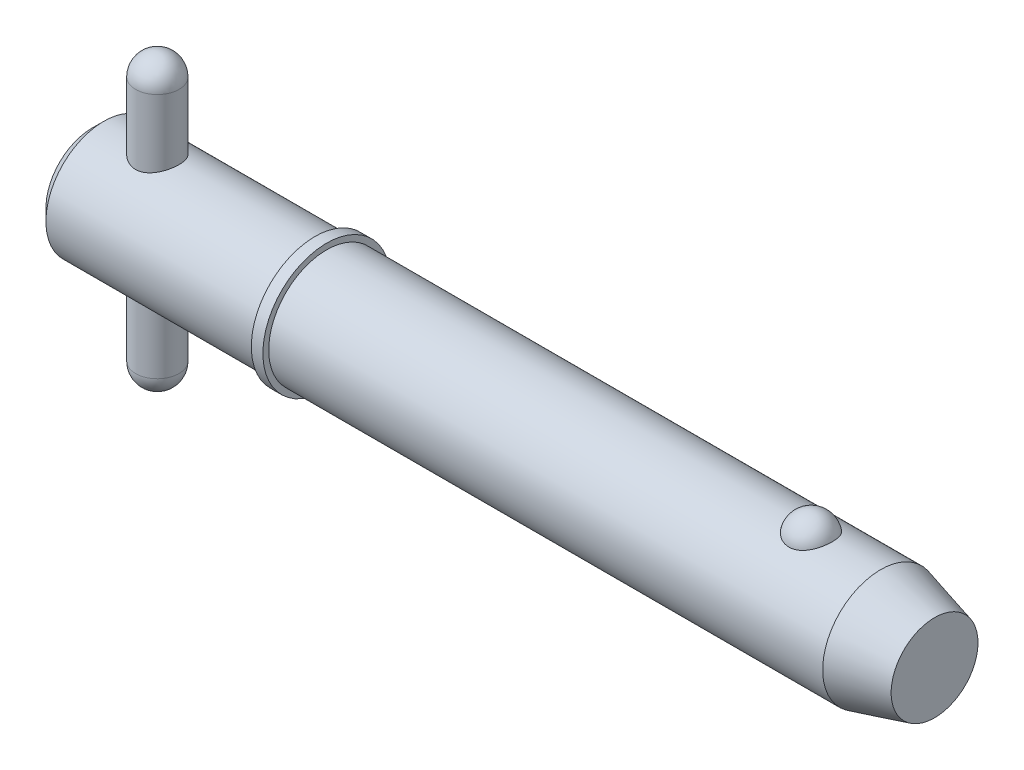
ISO-10303-21;
HEADER;
FILE_DESCRIPTION(('STEP AP214'),'2;1');
FILE_NAME('part.step','',(''),(''),'','','');
FILE_SCHEMA(('AUTOMOTIVE_DESIGN { 1 0 10303 214 1 1 1 1 }'));
ENDSEC;
DATA;
#1=APPLICATION_CONTEXT('core data for automotive mechanical design processes');
#2=APPLICATION_PROTOCOL_DEFINITION('international standard','automotive_design',2000,#1);
#3=PRODUCT_CONTEXT('',#1,'mechanical');
#4=PRODUCT('Part','Part','',(#3));
#5=PRODUCT_RELATED_PRODUCT_CATEGORY('part','',(#4));
#6=PRODUCT_DEFINITION_FORMATION('','',#4);
#7=PRODUCT_DEFINITION_CONTEXT('part definition',#1,'design');
#8=PRODUCT_DEFINITION('design','',#6,#7);
#9=PRODUCT_DEFINITION_SHAPE('','',#8);
#10=(LENGTH_UNIT() NAMED_UNIT(*) SI_UNIT(.MILLI.,.METRE.));
#11=(NAMED_UNIT(*) PLANE_ANGLE_UNIT() SI_UNIT($,.RADIAN.));
#12=(NAMED_UNIT(*) SI_UNIT($,.STERADIAN.) SOLID_ANGLE_UNIT());
#13=UNCERTAINTY_MEASURE_WITH_UNIT(LENGTH_MEASURE(1.E-05),#10,'distance_accuracy_value','');
#14=(GEOMETRIC_REPRESENTATION_CONTEXT(3) GLOBAL_UNCERTAINTY_ASSIGNED_CONTEXT((#13)) GLOBAL_UNIT_ASSIGNED_CONTEXT((#10,
#11,#12)) REPRESENTATION_CONTEXT('',''));
#15=CARTESIAN_POINT('',(0.,0.,0.));
#16=DIRECTION('',(0.,0.,1.));
#17=DIRECTION('',(1.,0.,0.));
#18=AXIS2_PLACEMENT_3D('',#15,#16,#17);
#19=CARTESIAN_POINT('',(7.14,15.875,0.));
#20=DIRECTION('',(0.,-1.,0.));
#21=DIRECTION('',(0.,0.,-1.));
#22=AXIS2_PLACEMENT_3D('',#19,#20,#21);
#23=CYLINDRICAL_SURFACE('',#22,2.38);
#24=CARTESIAN_POINT('',(7.14,-13.495,0.));
#25=DIRECTION('',(0.,-1.,0.));
#26=DIRECTION('',(0.,0.,-1.));
#27=AXIS2_PLACEMENT_3D('',#24,#25,#26);
#28=CIRCLE('',#27,2.38);
#29=CARTESIAN_POINT('',(7.14,-13.495,-2.38));
#30=VERTEX_POINT('',#29);
#31=EDGE_CURVE('P0_E10',#30,#30,#28,.F.);
#32=ORIENTED_EDGE('',*,*,#31,.T.);
#33=EDGE_LOOP('',(#32));
#34=FACE_BOUND('',#33,.T.);
#35=CARTESIAN_POINT('',(7.14,13.495,0.));
#36=DIRECTION('',(0.,-1.,0.));
#37=DIRECTION('',(0.,0.,-1.));
#38=AXIS2_PLACEMENT_3D('',#35,#36,#37);
#39=CIRCLE('',#38,2.38);
#40=CARTESIAN_POINT('',(7.14,13.495,-2.38));
#41=VERTEX_POINT('',#40);
#42=EDGE_CURVE('P0_E21',#41,#41,#39,.T.);
#43=ORIENTED_EDGE('',*,*,#42,.T.);
#44=EDGE_LOOP('',(#43));
#45=FACE_BOUND('',#44,.T.);
#46=ADVANCED_FACE('P0_F14',(#34,#45),#23,.T.);
#47=CARTESIAN_POINT('',(7.14,-13.495,0.));
#48=DIRECTION('',(0.,0.,1.));
#49=DIRECTION('',(1.,0.,0.));
#50=AXIS2_PLACEMENT_3D('',#47,#48,#49);
#51=SPHERICAL_SURFACE('',#50,2.38);
#52=CARTESIAN_POINT('',(7.14,-13.495,0.));
#53=DIRECTION('',(0.,-1.,0.));
#54=DIRECTION('',(0.,0.,-1.));
#55=AXIS2_PLACEMENT_3D('',#52,#53,#54);
#56=SPHERICAL_SURFACE('',#55,2.38);
#57=ORIENTED_EDGE('',*,*,#31,.F.);
#58=EDGE_LOOP('',(#57));
#59=FACE_BOUND('',#58,.T.);
#60=ADVANCED_FACE('P0_F29',(#59),#56,.T.);
#61=CARTESIAN_POINT('',(7.14,13.495,0.));
#62=DIRECTION('',(0.,0.,1.));
#63=DIRECTION('',(1.,0.,0.));
#64=AXIS2_PLACEMENT_3D('',#61,#62,#63);
#65=SPHERICAL_SURFACE('',#64,2.38);
#66=CARTESIAN_POINT('',(7.14,13.495,0.));
#67=DIRECTION('',(0.,-1.,0.));
#68=DIRECTION('',(0.,0.,-1.));
#69=AXIS2_PLACEMENT_3D('',#66,#67,#68);
#70=SPHERICAL_SURFACE('',#69,2.38);
#71=ORIENTED_EDGE('',*,*,#42,.F.);
#72=EDGE_LOOP('',(#71));
#73=FACE_BOUND('',#72,.T.);
#74=ADVANCED_FACE('P0_F16',(#73),#70,.T.);
#75=CLOSED_SHELL('',(#46,#60,#74));
#76=MANIFOLD_SOLID_BREP('P0_B1',#75);
#77=CARTESIAN_POINT('',(0.,0.,0.));
#78=DIRECTION('',(1.,0.,0.));
#79=DIRECTION('',(0.,0.,-1.));
#80=AXIS2_PLACEMENT_3D('',#77,#78,#79);
#81=CYLINDRICAL_SURFACE('',#80,6.35);
#82=CARTESIAN_POINT('',(86.4553693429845,0.,0.));
#83=DIRECTION('',(1.,0.,0.));
#84=DIRECTION('',(0.,0.,-1.));
#85=AXIS2_PLACEMENT_3D('',#82,#83,#84);
#86=CIRCLE('',#85,6.35);
#87=CARTESIAN_POINT('',(86.4553693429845,0.,-6.35));
#88=VERTEX_POINT('',#87);
#89=EDGE_CURVE('P1_E81',#88,#88,#86,.T.);
#90=ORIENTED_EDGE('',*,*,#89,.F.);
#91=EDGE_LOOP('',(#90));
#92=FACE_BOUND('',#91,.T.);
#93=CARTESIAN_POINT('',(25.7,0.,0.));
#94=DIRECTION('',(1.,0.,0.));
#95=DIRECTION('',(0.,0.,-1.));
#96=AXIS2_PLACEMENT_3D('',#93,#94,#95);
#97=CIRCLE('',#96,6.35);
#98=CARTESIAN_POINT('',(25.7,0.,-6.35));
#99=VERTEX_POINT('',#98);
#100=EDGE_CURVE('P1_E85',#99,#99,#97,.T.);
#101=ORIENTED_EDGE('',*,*,#100,.T.);
#102=EDGE_LOOP('',(#101));
#103=FACE_BOUND('',#102,.T.);
#104=CARTESIAN_POINT('',(78.8300214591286,5.87502187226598,2.40969251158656));
#105=CARTESIAN_POINT('',(78.7050305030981,5.87501645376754,2.40969773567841));
#106=CARTESIAN_POINT('',(78.5800806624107,5.87916061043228,2.39967292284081));
#107=CARTESIAN_POINT('',(78.3339091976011,5.89523112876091,2.35991730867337));
#108=CARTESIAN_POINT('',(78.2126863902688,5.90715499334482,2.33019283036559));
#109=CARTESIAN_POINT('',(77.9775170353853,5.9373956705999,2.25201402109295));
#110=CARTESIAN_POINT('',(77.8635602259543,5.95570321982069,2.20358681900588));
#111=CARTESIAN_POINT('',(77.6455735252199,5.99672067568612,2.08937987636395));
#112=CARTESIAN_POINT('',(77.5415457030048,6.01943149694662,2.02359652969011));
#113=CARTESIAN_POINT('',(77.3429437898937,6.06760647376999,1.87428969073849));
#114=CARTESIAN_POINT('',(77.2487268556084,6.09313095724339,1.79031110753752));
#115=CARTESIAN_POINT('',(77.0752557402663,6.14375873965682,1.60800178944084));
#116=CARTESIAN_POINT('',(76.9960043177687,6.16886196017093,1.50966841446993));
#117=CARTESIAN_POINT('',(76.8508457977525,6.2172460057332,1.29645884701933));
#118=CARTESIAN_POINT('',(76.7856885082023,6.24039621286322,1.18104158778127));
#119=CARTESIAN_POINT('',(76.6747035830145,6.28117277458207,0.940351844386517));
#120=CARTESIAN_POINT('',(76.6288776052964,6.29879865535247,0.815078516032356));
#121=CARTESIAN_POINT('',(76.5570234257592,6.32692073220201,0.556494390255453));
#122=CARTESIAN_POINT('',(76.531249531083,6.33732517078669,0.423102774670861));
#123=CARTESIAN_POINT('',(76.5009885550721,6.34957673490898,0.153542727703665));
#124=CARTESIAN_POINT('',(76.4965009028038,6.35142408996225,0.017374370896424));
#125=CARTESIAN_POINT('',(76.5088655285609,6.34638925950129,-0.253036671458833));
#126=CARTESIAN_POINT('',(76.5255949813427,6.33955731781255,-0.387285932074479));
#127=CARTESIAN_POINT('',(76.5798438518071,6.31794129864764,-0.650851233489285));
#128=CARTESIAN_POINT('',(76.6173636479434,6.30315707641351,-0.7801671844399));
#129=CARTESIAN_POINT('',(76.712500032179,6.26711642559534,-1.03041949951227));
#130=CARTESIAN_POINT('',(76.770143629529,6.24585130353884,-1.1513443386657));
#131=CARTESIAN_POINT('',(76.9043522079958,6.19905619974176,-1.38129800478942));
#132=CARTESIAN_POINT('',(76.9809187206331,6.17352587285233,-1.49032586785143));
#133=CARTESIAN_POINT('',(77.1517538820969,6.12080227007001,-1.69393164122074));
#134=CARTESIAN_POINT('',(77.2461008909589,6.09360200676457,-1.78844209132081));
#135=CARTESIAN_POINT('',(77.4501196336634,6.0407043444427,-1.95970536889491));
#136=CARTESIAN_POINT('',(77.5597900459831,6.01500681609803,-2.03645972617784));
#137=CARTESIAN_POINT('',(77.7891876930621,5.96867714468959,-2.16845644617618));
#138=CARTESIAN_POINT('',(77.9086522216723,5.94794910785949,-2.22412062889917));
#139=CARTESIAN_POINT('',(78.1562188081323,5.91340580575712,-2.31440992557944));
#140=CARTESIAN_POINT('',(78.2843175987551,5.89958794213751,-2.34904294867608));
#141=CARTESIAN_POINT('',(78.538582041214,5.88111049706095,-2.39491590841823));
#142=CARTESIAN_POINT('',(78.6645207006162,5.87602512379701,-2.40724512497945));
#143=CARTESIAN_POINT('',(78.9167867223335,5.87428980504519,-2.41147867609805));
#144=CARTESIAN_POINT('',(79.043114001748,5.87763817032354,-2.40338710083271));
#145=CARTESIAN_POINT('',(79.2884170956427,5.89212921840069,-2.36762715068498));
#146=CARTESIAN_POINT('',(79.4074992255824,5.90302431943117,-2.34058030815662));
#147=CARTESIAN_POINT('',(79.6392447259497,5.93113752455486,-2.2683906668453));
#148=CARTESIAN_POINT('',(79.7519075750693,5.94835614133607,-2.22324640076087));
#149=CARTESIAN_POINT('',(79.9704009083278,5.98773016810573,-2.11493806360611));
#150=CARTESIAN_POINT('',(80.076028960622,6.00998499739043,-2.05140269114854));
#151=CARTESIAN_POINT('',(80.2753006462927,6.0569014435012,-1.90842705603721));
#152=CARTESIAN_POINT('',(80.3689415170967,6.08156361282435,-1.82898313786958));
#153=CARTESIAN_POINT('',(80.5466754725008,6.13211715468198,-1.6518242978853));
#154=CARTESIAN_POINT('',(80.630055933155,6.15800825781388,-1.55339381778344));
#155=CARTESIAN_POINT('',(80.7797900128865,6.20712834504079,-1.34374214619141));
#156=CARTESIAN_POINT('',(80.8461405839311,6.23035685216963,-1.23251867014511));
#157=CARTESIAN_POINT('',(80.9623455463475,6.27251177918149,-0.99644720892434));
#158=CARTESIAN_POINT('',(81.0116072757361,6.29127762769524,-0.871278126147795));
#159=CARTESIAN_POINT('',(81.0896142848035,6.3215862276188,-0.613870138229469));
#160=CARTESIAN_POINT('',(81.1183593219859,6.33312889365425,-0.481631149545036));
#161=CARTESIAN_POINT('',(81.1547705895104,6.34782349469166,-0.213672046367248));
#162=CARTESIAN_POINT('',(81.1624134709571,6.35096613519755,-0.077948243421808));
#163=CARTESIAN_POINT('',(81.1563951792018,6.34851322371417,0.19294395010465));
#164=CARTESIAN_POINT('',(81.1427343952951,6.3429178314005,0.328112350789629));
#165=CARTESIAN_POINT('',(81.0945036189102,6.32360512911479,0.593406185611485));
#166=CARTESIAN_POINT('',(81.0600313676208,6.30992579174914,0.723552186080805));
#167=CARTESIAN_POINT('',(80.9709539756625,6.27586325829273,0.975834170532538));
#168=CARTESIAN_POINT('',(80.9163476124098,6.25547965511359,1.09796966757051));
#169=CARTESIAN_POINT('',(80.7877587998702,6.20998183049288,1.33148921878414));
#170=CARTESIAN_POINT('',(80.7136742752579,6.18484288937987,1.44281227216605));
#171=CARTESIAN_POINT('',(80.5478204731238,6.13258735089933,1.65087683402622));
#172=CARTESIAN_POINT('',(80.4560515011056,6.10547078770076,1.74761859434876));
#173=CARTESIAN_POINT('',(80.2571839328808,6.05235879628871,1.92350926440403));
#174=CARTESIAN_POINT('',(80.150133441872,6.02636017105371,2.00271146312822));
#175=CARTESIAN_POINT('',(79.9231384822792,5.97843747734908,2.14154159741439));
#176=CARTESIAN_POINT('',(79.803191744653,5.95651412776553,2.2011660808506));
#177=CARTESIAN_POINT('',(79.5445236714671,5.91812106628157,2.30250570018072));
#178=CARTESIAN_POINT('',(79.4050698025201,5.90217533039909,2.34256795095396));
#179=CARTESIAN_POINT('',(79.1203974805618,5.88063128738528,2.39615214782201));
#180=CARTESIAN_POINT('',(78.9751817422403,5.87502816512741,2.40968644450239));
#181=CARTESIAN_POINT('',(78.8300214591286,5.87502187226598,2.40969251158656));
#182=B_SPLINE_CURVE_WITH_KNOTS('',3,(#104,#105,#106,#107,#108,#109,#110,#111,#112,#113,#114,
#115,#116,#117,#118,#119,#120,#121,#122,#123,#124,#125,#126,#127,#128,#129,#130,#131,#132,#133,
#134,#135,#136,#137,#138,#139,#140,#141,#142,#143,#144,#145,#146,#147,#148,#149,#150,#151,#152,
#153,#154,#155,#156,#157,#158,#159,#160,#161,#162,#163,#164,#165,#166,#167,#168,#169,#170,#171,
#172,#173,#174,#175,#176,#177,#178,#179,#180,#181),.UNSPECIFIED.,.T.,.F.,(4,2,2,2,2,2,2,2,2,2,2,
2,2,2,2,2,2,2,2,2,2,2,2,2,2,2,2,2,2,2,2,2,2,2,2,2,2,2,4),(0.,0.374440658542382,
0.748761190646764,1.12254078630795,1.49639810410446,1.8809887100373,2.26565013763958,
2.66741104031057,3.0692063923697,3.47601794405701,3.88281858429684,4.28727498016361,
4.69173873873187,5.09674745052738,5.50178895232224,5.90865911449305,6.31549420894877,
6.71369855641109,7.11175305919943,7.48978077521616,7.86773278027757,8.23383886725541,
8.59997464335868,8.97409044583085,9.34829231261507,9.74122667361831,10.1342313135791,
10.539752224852,10.945277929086,11.3512521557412,11.7572189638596,12.1612938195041,
12.5653932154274,12.9716540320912,13.37790783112,13.782909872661,14.1879832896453,
14.6230486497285,15.0579114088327),.UNSPECIFIED.);
#183=CARTESIAN_POINT('',(78.8300214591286,5.87502187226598,2.40969251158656));
#184=VERTEX_POINT('',#183);
#185=EDGE_CURVE('P1_E35',#184,#184,#182,.T.);
#186=ORIENTED_EDGE('',*,*,#185,.T.);
#187=EDGE_LOOP('',(#186));
#188=FACE_BOUND('',#187,.T.);
#189=ADVANCED_FACE('P1_F13',(#92,#103,#188),#81,.T.);
#190=CARTESIAN_POINT('',(0.,0.,0.));
#191=DIRECTION('',(-1.,0.,0.));
#192=DIRECTION('',(0.,0.,1.));
#193=AXIS2_PLACEMENT_3D('',#190,#191,#192);
#194=PLANE('',#193);
#195=CARTESIAN_POINT('',(0.,0.,0.));
#196=DIRECTION('',(1.,0.,0.));
#197=DIRECTION('',(0.,0.,-1.));
#198=AXIS2_PLACEMENT_3D('',#195,#196,#197);
#199=CIRCLE('',#198,5.08);
#200=CARTESIAN_POINT('',(0.,0.,-5.08));
#201=VERTEX_POINT('',#200);
#202=EDGE_CURVE('P1_E9',#201,#201,#199,.T.);
#203=ORIENTED_EDGE('',*,*,#202,.F.);
#204=EDGE_LOOP('',(#203));
#205=FACE_BOUND('',#204,.T.);
#206=ADVANCED_FACE('P1_F15',(#205),#194,.T.);
#207=CARTESIAN_POINT('',(1.27,0.,0.));
#208=DIRECTION('',(1.,0.,0.));
#209=DIRECTION('',(0.,0.,-1.));
#210=AXIS2_PLACEMENT_3D('',#207,#208,#209);
#211=CONICAL_SURFACE('',#210,6.35,0.78539816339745);
#212=ORIENTED_EDGE('',*,*,#202,.T.);
#213=EDGE_LOOP('',(#212));
#214=FACE_BOUND('',#213,.T.);
#215=CARTESIAN_POINT('',(1.27,0.,0.));
#216=DIRECTION('',(1.,0.,0.));
#217=DIRECTION('',(0.,0.,-1.));
#218=AXIS2_PLACEMENT_3D('',#215,#216,#217);
#219=CIRCLE('',#218,6.35);
#220=CARTESIAN_POINT('',(1.27,0.,-6.35));
#221=VERTEX_POINT('',#220);
#222=EDGE_CURVE('P1_E26',#221,#221,#219,.T.);
#223=ORIENTED_EDGE('',*,*,#222,.F.);
#224=EDGE_LOOP('',(#223));
#225=FACE_BOUND('',#224,.T.);
#226=ADVANCED_FACE('P1_F77',(#214,#225),#211,.T.);
#227=CARTESIAN_POINT('',(0.,0.,0.));
#228=DIRECTION('',(1.,0.,0.));
#229=DIRECTION('',(0.,0.,-1.));
#230=AXIS2_PLACEMENT_3D('',#227,#228,#229);
#231=CYLINDRICAL_SURFACE('',#230,6.35);
#232=CARTESIAN_POINT('',(7.14,-5.88711304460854,2.38));
#233=CARTESIAN_POINT('',(7.01146258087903,-5.88710856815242,2.38000480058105));
#234=CARTESIAN_POINT('',(6.88295682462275,-5.89136840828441,2.36955244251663));
#235=CARTESIAN_POINT('',(6.62981934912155,-5.90782785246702,2.32820953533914));
#236=CARTESIAN_POINT('',(6.50518751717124,-5.92002722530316,2.29731958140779));
#237=CARTESIAN_POINT('',(6.26352403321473,-5.95079384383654,2.21639366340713));
#238=CARTESIAN_POINT('',(6.14647496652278,-5.96934583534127,2.16640353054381));
#239=CARTESIAN_POINT('',(5.92237941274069,-6.01070278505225,2.04885862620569));
#240=CARTESIAN_POINT('',(5.81533593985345,-6.03350901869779,1.98129858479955));
#241=CARTESIAN_POINT('',(5.60897525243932,-6.08207341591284,1.82693902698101));
#242=CARTESIAN_POINT('',(5.51022503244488,-6.10791836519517,1.73940861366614));
#243=CARTESIAN_POINT('',(5.32840561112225,-6.15892405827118,1.54914379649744));
#244=CARTESIAN_POINT('',(5.24533975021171,-6.1840846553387,1.44640616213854));
#245=CARTESIAN_POINT('',(5.09451639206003,-6.23191821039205,1.22434014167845));
#246=CARTESIAN_POINT('',(5.02737511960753,-6.25447755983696,1.10456656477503));
#247=CARTESIAN_POINT('',(4.91443001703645,-6.2935236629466,0.854429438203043));
#248=CARTESIAN_POINT('',(4.86861879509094,-6.31001251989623,0.724069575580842));
#249=CARTESIAN_POINT('',(4.80162253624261,-6.33444370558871,0.46242122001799));
#250=CARTESIAN_POINT('',(4.77946137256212,-6.34272370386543,0.331414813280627));
#251=CARTESIAN_POINT('',(4.75726677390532,-6.35101600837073,0.0672982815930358));
#252=CARTESIAN_POINT('',(4.75722615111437,-6.35103100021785,-0.0658111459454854));
#253=CARTESIAN_POINT('',(4.77870510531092,-6.3430064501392,-0.323358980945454));
#254=CARTESIAN_POINT('',(4.79915922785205,-6.33536494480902,-0.447900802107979));
#255=CARTESIAN_POINT('',(4.85925493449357,-6.31340794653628,-0.69163609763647));
#256=CARTESIAN_POINT('',(4.89889787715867,-6.29909198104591,-0.810829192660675));
#257=CARTESIAN_POINT('',(4.9967414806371,-6.26494471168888,-1.04254212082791));
#258=CARTESIAN_POINT('',(5.05520370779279,-6.24503620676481,-1.1549396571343));
#259=CARTESIAN_POINT('',(5.1887948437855,-6.20171869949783,-1.3686079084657));
#260=CARTESIAN_POINT('',(5.26392912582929,-6.17830856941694,-1.46987502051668));
#261=CARTESIAN_POINT('',(5.43386591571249,-6.12878580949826,-1.66468415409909));
#262=CARTESIAN_POINT('',(5.52956139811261,-6.10259519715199,-1.75742857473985));
#263=CARTESIAN_POINT('',(5.73530435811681,-6.05155777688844,-1.92585331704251));
#264=CARTESIAN_POINT('',(5.84535542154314,-6.02671130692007,-2.00152936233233));
#265=CARTESIAN_POINT('',(6.07982989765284,-5.98068420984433,-2.13519109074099));
#266=CARTESIAN_POINT('',(6.20451768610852,-5.95959698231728,-2.19274775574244));
#267=CARTESIAN_POINT('',(6.4628145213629,-5.92455622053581,-2.28574558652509));
#268=CARTESIAN_POINT('',(6.59641856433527,-5.91059872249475,-2.32119904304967));
#269=CARTESIAN_POINT('',(6.86087441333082,-5.8923327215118,-2.36717069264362));
#270=CARTESIAN_POINT('',(6.99147192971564,-5.8875347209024,-2.37895573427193));
#271=CARTESIAN_POINT('',(7.25283805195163,-5.88674545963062,-2.38091046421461));
#272=CARTESIAN_POINT('',(7.38360660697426,-5.89075200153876,-2.37108554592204));
#273=CARTESIAN_POINT('',(7.63510696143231,-5.90662331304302,-2.33124781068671));
#274=CARTESIAN_POINT('',(7.75602069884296,-5.91810660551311,-2.30221396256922));
#275=CARTESIAN_POINT('',(7.99120505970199,-5.94718527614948,-2.22601401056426));
#276=CARTESIAN_POINT('',(8.10547431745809,-5.96478190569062,-2.17884419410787));
#277=CARTESIAN_POINT('',(8.32888632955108,-6.00491533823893,-2.06572311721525));
#278=CARTESIAN_POINT('',(8.43767672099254,-6.02761250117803,-1.99913452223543));
#279=CARTESIAN_POINT('',(8.6429894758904,-6.07511988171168,-1.84974438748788));
#280=CARTESIAN_POINT('',(8.73950733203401,-6.09993087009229,-1.76693691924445));
#281=CARTESIAN_POINT('',(8.9238741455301,-6.1507686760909,-1.58125563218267));
#282=CARTESIAN_POINT('',(9.01078732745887,-6.17677301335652,-1.47744327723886));
#283=CARTESIAN_POINT('',(9.16607127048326,-6.22556172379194,-1.25606967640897));
#284=CARTESIAN_POINT('',(9.23444197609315,-6.24834608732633,-1.13850838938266));
#285=CARTESIAN_POINT('',(9.3502493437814,-6.28811144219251,-0.893050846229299));
#286=CARTESIAN_POINT('',(9.39775808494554,-6.30511236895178,-0.765192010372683));
#287=CARTESIAN_POINT('',(9.47032640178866,-6.33145833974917,-0.502514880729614));
#288=CARTESIAN_POINT('',(9.49539651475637,-6.34080697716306,-0.367699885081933));
#289=CARTESIAN_POINT('',(9.52124059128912,-6.35045496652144,-0.103396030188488));
#290=CARTESIAN_POINT('',(9.52334421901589,-6.35124952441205,0.025945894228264));
#291=CARTESIAN_POINT('',(9.50661518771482,-6.34499064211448,0.283061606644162));
#292=CARTESIAN_POINT('',(9.48778504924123,-6.33793814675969,0.410835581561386));
#293=CARTESIAN_POINT('',(9.43065630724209,-6.31700307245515,0.658028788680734));
#294=CARTESIAN_POINT('',(9.39284291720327,-6.30329098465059,0.7775756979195));
#295=CARTESIAN_POINT('',(9.29930406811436,-6.27046903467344,1.00863789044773));
#296=CARTESIAN_POINT('',(9.2435752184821,-6.25135815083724,1.12015164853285));
#297=CARTESIAN_POINT('',(9.11312349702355,-6.20865254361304,1.33711407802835));
#298=CARTESIAN_POINT('',(9.03770094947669,-6.18490316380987,1.44211105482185));
#299=CARTESIAN_POINT('',(8.87110640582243,-6.13583718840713,1.63836897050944));
#300=CARTESIAN_POINT('',(8.77992879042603,-6.11052003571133,1.72962498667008));
#301=CARTESIAN_POINT('',(8.57869799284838,-6.05953829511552,1.90076098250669));
#302=CARTESIAN_POINT('',(8.46790320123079,-6.03392573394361,1.97978778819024));
#303=CARTESIAN_POINT('',(8.23379693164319,-5.98676607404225,2.11813466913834));
#304=CARTESIAN_POINT('',(8.11048418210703,-5.9652193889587,2.17745273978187));
#305=CARTESIAN_POINT('',(7.84900037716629,-5.92818393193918,2.27641807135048));
#306=CARTESIAN_POINT('',(7.71041678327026,-5.91299857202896,2.31510015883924));
#307=CARTESIAN_POINT('',(7.42787316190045,-5.89246887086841,2.36688002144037));
#308=CARTESIAN_POINT('',(7.28391673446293,-5.88711805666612,2.37999462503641));
#309=CARTESIAN_POINT('',(7.14,-5.88711304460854,2.38));
#310=B_SPLINE_CURVE_WITH_KNOTS('',3,(#232,#233,#234,#235,#236,#237,#238,#239,#240,#241,#242,
#243,#244,#245,#246,#247,#248,#249,#250,#251,#252,#253,#254,#255,#256,#257,#258,#259,#260,#261,
#262,#263,#264,#265,#266,#267,#268,#269,#270,#271,#272,#273,#274,#275,#276,#277,#278,#279,#280,
#281,#282,#283,#284,#285,#286,#287,#288,#289,#290,#291,#292,#293,#294,#295,#296,#297,#298,#299,
#300,#301,#302,#303,#304,#305,#306,#307,#308,#309),.UNSPECIFIED.,.T.,.F.,(4,2,2,2,2,2,2,2,2,2,2,
2,2,2,2,2,2,2,2,2,2,2,2,2,2,2,2,2,2,2,2,2,2,2,2,2,2,2,4),(0.,0.385076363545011,
0.770141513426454,1.15428843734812,1.53855071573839,1.94016118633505,2.3418570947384,
2.75720522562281,3.1724093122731,3.569721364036,3.96690431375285,4.34445758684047,
4.72203759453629,5.10511017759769,5.48830640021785,5.89390240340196,6.29959991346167,
6.71428455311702,7.12873839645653,7.52034494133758,7.91185376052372,8.28480528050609,
8.65783318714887,9.0448340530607,9.43197664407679,9.84363087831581,10.2552863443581,
10.6655081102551,11.0755371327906,11.4616919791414,11.847800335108,12.224507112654,
12.6012852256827,12.9938941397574,13.386643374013,13.8000944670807,14.2135876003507,
14.6450218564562,15.0761720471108),.UNSPECIFIED.);
#311=CARTESIAN_POINT('',(7.14,-5.88711304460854,2.38));
#312=VERTEX_POINT('',#311);
#313=EDGE_CURVE('P1_E17',#312,#312,#310,.T.);
#314=ORIENTED_EDGE('',*,*,#313,.F.);
#315=EDGE_LOOP('',(#314));
#316=FACE_BOUND('',#315,.T.);
#317=CARTESIAN_POINT('',(7.14,5.88711304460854,2.38));
#318=CARTESIAN_POINT('',(7.26853741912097,5.88710856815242,2.38000480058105));
#319=CARTESIAN_POINT('',(7.39704317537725,5.89136840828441,2.36955244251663));
#320=CARTESIAN_POINT('',(7.65018065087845,5.90782785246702,2.32820953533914));
#321=CARTESIAN_POINT('',(7.77481248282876,5.92002722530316,2.29731958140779));
#322=CARTESIAN_POINT('',(8.01647596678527,5.95079384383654,2.21639366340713));
#323=CARTESIAN_POINT('',(8.13352503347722,5.96934583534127,2.16640353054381));
#324=CARTESIAN_POINT('',(8.35762058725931,6.01070278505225,2.04885862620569));
#325=CARTESIAN_POINT('',(8.46466406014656,6.03350901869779,1.98129858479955));
#326=CARTESIAN_POINT('',(8.67102474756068,6.08207341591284,1.82693902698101));
#327=CARTESIAN_POINT('',(8.76977496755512,6.10791836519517,1.73940861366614));
#328=CARTESIAN_POINT('',(8.95159438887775,6.15892405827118,1.54914379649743));
#329=CARTESIAN_POINT('',(9.03466024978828,6.1840846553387,1.44640616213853));
#330=CARTESIAN_POINT('',(9.18548360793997,6.23191821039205,1.22434014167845));
#331=CARTESIAN_POINT('',(9.25262488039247,6.25447755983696,1.10456656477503));
#332=CARTESIAN_POINT('',(9.36556998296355,6.2935236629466,0.854429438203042));
#333=CARTESIAN_POINT('',(9.41138120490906,6.31001251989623,0.72406957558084));
#334=CARTESIAN_POINT('',(9.47837746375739,6.33444370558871,0.462421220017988));
#335=CARTESIAN_POINT('',(9.50053862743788,6.34272370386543,0.331414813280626));
#336=CARTESIAN_POINT('',(9.52273322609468,6.35101600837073,0.0672982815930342));
#337=CARTESIAN_POINT('',(9.52277384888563,6.35103100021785,-0.0658111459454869));
#338=CARTESIAN_POINT('',(9.50129489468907,6.3430064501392,-0.323358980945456));
#339=CARTESIAN_POINT('',(9.48084077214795,6.33536494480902,-0.447900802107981));
#340=CARTESIAN_POINT('',(9.42074506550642,6.31340794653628,-0.691636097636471));
#341=CARTESIAN_POINT('',(9.38110212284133,6.29909198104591,-0.810829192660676));
#342=CARTESIAN_POINT('',(9.2832585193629,6.26494471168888,-1.04254212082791));
#343=CARTESIAN_POINT('',(9.22479629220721,6.24503620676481,-1.1549396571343));
#344=CARTESIAN_POINT('',(9.0912051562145,6.20171869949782,-1.3686079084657));
#345=CARTESIAN_POINT('',(9.0160708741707,6.17830856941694,-1.46987502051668));
#346=CARTESIAN_POINT('',(8.84613408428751,6.12878580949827,-1.66468415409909));
#347=CARTESIAN_POINT('',(8.75043860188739,6.10259519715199,-1.75742857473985));
#348=CARTESIAN_POINT('',(8.54469564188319,6.05155777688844,-1.92585331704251));
#349=CARTESIAN_POINT('',(8.43464457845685,6.02671130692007,-2.00152936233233));
#350=CARTESIAN_POINT('',(8.20017010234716,5.98068420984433,-2.13519109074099));
#351=CARTESIAN_POINT('',(8.07548231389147,5.95959698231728,-2.19274775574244));
#352=CARTESIAN_POINT('',(7.8171854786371,5.9245562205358,-2.28574558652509));
#353=CARTESIAN_POINT('',(7.68358143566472,5.91059872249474,-2.32119904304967));
#354=CARTESIAN_POINT('',(7.41912558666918,5.8923327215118,-2.36717069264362));
#355=CARTESIAN_POINT('',(7.28852807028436,5.8875347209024,-2.37895573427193));
#356=CARTESIAN_POINT('',(7.02716194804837,5.88674545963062,-2.38091046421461));
#357=CARTESIAN_POINT('',(6.89639339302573,5.89075200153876,-2.37108554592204));
#358=CARTESIAN_POINT('',(6.64489303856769,5.90662331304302,-2.33124781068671));
#359=CARTESIAN_POINT('',(6.52397930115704,5.91810660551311,-2.30221396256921));
#360=CARTESIAN_POINT('',(6.288794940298,5.94718527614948,-2.22601401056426));
#361=CARTESIAN_POINT('',(6.17452568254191,5.96478190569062,-2.17884419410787));
#362=CARTESIAN_POINT('',(5.95111367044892,6.00491533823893,-2.06572311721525));
#363=CARTESIAN_POINT('',(5.84232327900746,6.02761250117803,-1.99913452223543));
#364=CARTESIAN_POINT('',(5.6370105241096,6.07511988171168,-1.84974438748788));
#365=CARTESIAN_POINT('',(5.54049266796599,6.09993087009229,-1.76693691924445));
#366=CARTESIAN_POINT('',(5.3561258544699,6.1507686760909,-1.58125563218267));
#367=CARTESIAN_POINT('',(5.26921267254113,6.17677301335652,-1.47744327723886));
#368=CARTESIAN_POINT('',(5.11392872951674,6.22556172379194,-1.25606967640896));
#369=CARTESIAN_POINT('',(5.04555802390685,6.24834608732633,-1.13850838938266));
#370=CARTESIAN_POINT('',(4.9297506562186,6.28811144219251,-0.893050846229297));
#371=CARTESIAN_POINT('',(4.88224191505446,6.30511236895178,-0.76519201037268));
#372=CARTESIAN_POINT('',(4.80967359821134,6.33145833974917,-0.502514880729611));
#373=CARTESIAN_POINT('',(4.78460348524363,6.34080697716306,-0.36769988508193));
#374=CARTESIAN_POINT('',(4.75875940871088,6.35045496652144,-0.103396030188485));
#375=CARTESIAN_POINT('',(4.75665578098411,6.35124952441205,0.025945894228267));
#376=CARTESIAN_POINT('',(4.77338481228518,6.34499064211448,0.283061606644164));
#377=CARTESIAN_POINT('',(4.79221495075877,6.33793814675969,0.410835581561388));
#378=CARTESIAN_POINT('',(4.84934369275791,6.31700307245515,0.658028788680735));
#379=CARTESIAN_POINT('',(4.88715708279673,6.30329098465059,0.777575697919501));
#380=CARTESIAN_POINT('',(4.98069593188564,6.27046903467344,1.00863789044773));
#381=CARTESIAN_POINT('',(5.0364247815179,6.25135815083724,1.12015164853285));
#382=CARTESIAN_POINT('',(5.16687650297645,6.20865254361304,1.33711407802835));
#383=CARTESIAN_POINT('',(5.24229905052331,6.18490316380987,1.44211105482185));
#384=CARTESIAN_POINT('',(5.40889359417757,6.13583718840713,1.63836897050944));
#385=CARTESIAN_POINT('',(5.50007120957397,6.11052003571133,1.72962498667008));
#386=CARTESIAN_POINT('',(5.70130200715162,6.05953829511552,1.90076098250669));
#387=CARTESIAN_POINT('',(5.81209679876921,6.03392573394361,1.97978778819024));
#388=CARTESIAN_POINT('',(6.04620306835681,5.98676607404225,2.11813466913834));
#389=CARTESIAN_POINT('',(6.16951581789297,5.9652193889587,2.17745273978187));
#390=CARTESIAN_POINT('',(6.43099962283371,5.92818393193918,2.27641807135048));
#391=CARTESIAN_POINT('',(6.56958321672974,5.91299857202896,2.31510015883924));
#392=CARTESIAN_POINT('',(6.85212683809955,5.89246887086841,2.36688002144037));
#393=CARTESIAN_POINT('',(6.99608326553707,5.88711805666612,2.37999462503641));
#394=CARTESIAN_POINT('',(7.14,5.88711304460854,2.38));
#395=B_SPLINE_CURVE_WITH_KNOTS('',3,(#317,#318,#319,#320,#321,#322,#323,#324,#325,#326,#327,
#328,#329,#330,#331,#332,#333,#334,#335,#336,#337,#338,#339,#340,#341,#342,#343,#344,#345,#346,
#347,#348,#349,#350,#351,#352,#353,#354,#355,#356,#357,#358,#359,#360,#361,#362,#363,#364,#365,
#366,#367,#368,#369,#370,#371,#372,#373,#374,#375,#376,#377,#378,#379,#380,#381,#382,#383,#384,
#385,#386,#387,#388,#389,#390,#391,#392,#393,#394),.UNSPECIFIED.,.T.,.F.,(4,2,2,2,2,2,2,2,2,2,2,
2,2,2,2,2,2,2,2,2,2,2,2,2,2,2,2,2,2,2,2,2,2,2,2,2,2,2,4),(0.,0.385076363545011,
0.770141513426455,1.15428843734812,1.53855071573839,1.94016118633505,2.3418570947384,
2.75720522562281,3.1724093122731,3.56972136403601,3.96690431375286,4.34445758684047,
4.72203759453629,5.10511017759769,5.48830640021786,5.89390240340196,6.29959991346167,
6.71428455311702,7.12873839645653,7.52034494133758,7.91185376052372,8.2848052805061,
8.65783318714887,9.0448340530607,9.43197664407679,9.84363087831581,10.2552863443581,
10.6655081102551,11.0755371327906,11.4616919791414,11.847800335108,12.2245071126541,
12.6012852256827,12.9938941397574,13.386643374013,13.8000944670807,14.2135876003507,
14.6450218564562,15.0761720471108),.UNSPECIFIED.);
#396=CARTESIAN_POINT('',(7.14,5.88711304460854,2.38));
#397=VERTEX_POINT('',#396);
#398=EDGE_CURVE('P1_E43',#397,#397,#395,.T.);
#399=ORIENTED_EDGE('',*,*,#398,.F.);
#400=EDGE_LOOP('',(#399));
#401=FACE_BOUND('',#400,.T.);
#402=ORIENTED_EDGE('',*,*,#222,.T.);
#403=EDGE_LOOP('',(#402));
#404=FACE_BOUND('',#403,.T.);
#405=CARTESIAN_POINT('',(24.43,0.,0.));
#406=DIRECTION('',(1.,0.,0.));
#407=DIRECTION('',(0.,0.,-1.));
#408=AXIS2_PLACEMENT_3D('',#405,#406,#407);
#409=CIRCLE('',#408,6.35);
#410=CARTESIAN_POINT('',(24.43,0.,-6.35));
#411=VERTEX_POINT('',#410);
#412=EDGE_CURVE('P1_E31',#411,#411,#409,.T.);
#413=ORIENTED_EDGE('',*,*,#412,.F.);
#414=EDGE_LOOP('',(#413));
#415=FACE_BOUND('',#414,.T.);
#416=ADVANCED_FACE('P1_F103',(#316,#401,#404,#415),#231,.T.);
#417=CARTESIAN_POINT('',(24.43,6.35,0.));
#418=DIRECTION('',(-1.,0.,0.));
#419=DIRECTION('',(0.,0.,1.));
#420=AXIS2_PLACEMENT_3D('',#417,#418,#419);
#421=PLANE('',#420);
#422=ORIENTED_EDGE('',*,*,#412,.T.);
#423=EDGE_LOOP('',(#422));
#424=FACE_BOUND('',#423,.T.);
#425=CARTESIAN_POINT('',(24.43,0.,0.));
#426=DIRECTION('',(1.,0.,0.));
#427=DIRECTION('',(0.,0.,-1.));
#428=AXIS2_PLACEMENT_3D('',#425,#426,#427);
#429=CIRCLE('',#428,6.985);
#430=CARTESIAN_POINT('',(24.43,0.,-6.985));
#431=VERTEX_POINT('',#430);
#432=EDGE_CURVE('P1_E91',#431,#431,#429,.T.);
#433=ORIENTED_EDGE('',*,*,#432,.F.);
#434=EDGE_LOOP('',(#433));
#435=FACE_BOUND('',#434,.T.);
#436=ADVANCED_FACE('P1_F100',(#424,#435),#421,.T.);
#437=CARTESIAN_POINT('',(0.,0.,0.));
#438=DIRECTION('',(1.,0.,0.));
#439=DIRECTION('',(0.,0.,-1.));
#440=AXIS2_PLACEMENT_3D('',#437,#438,#439);
#441=CYLINDRICAL_SURFACE('',#440,6.985);
#442=ORIENTED_EDGE('',*,*,#432,.T.);
#443=EDGE_LOOP('',(#442));
#444=FACE_BOUND('',#443,.T.);
#445=CARTESIAN_POINT('',(25.7,0.,0.));
#446=DIRECTION('',(1.,0.,0.));
#447=DIRECTION('',(0.,0.,-1.));
#448=AXIS2_PLACEMENT_3D('',#445,#446,#447);
#449=CIRCLE('',#448,6.985);
#450=CARTESIAN_POINT('',(25.7,0.,-6.985));
#451=VERTEX_POINT('',#450);
#452=EDGE_CURVE('P1_E88',#451,#451,#449,.T.);
#453=ORIENTED_EDGE('',*,*,#452,.F.);
#454=EDGE_LOOP('',(#453));
#455=FACE_BOUND('',#454,.T.);
#456=ADVANCED_FACE('P1_F68',(#444,#455),#441,.T.);
#457=CARTESIAN_POINT('',(25.7,6.985,0.));
#458=DIRECTION('',(1.,0.,0.));
#459=DIRECTION('',(0.,0.,-1.));
#460=AXIS2_PLACEMENT_3D('',#457,#458,#459);
#461=PLANE('',#460);
#462=ORIENTED_EDGE('',*,*,#452,.T.);
#463=EDGE_LOOP('',(#462));
#464=FACE_BOUND('',#463,.T.);
#465=ORIENTED_EDGE('',*,*,#100,.F.);
#466=EDGE_LOOP('',(#465));
#467=FACE_BOUND('',#466,.T.);
#468=ADVANCED_FACE('P1_F62',(#464,#467),#461,.T.);
#469=CARTESIAN_POINT('',(92.38,0.,0.));
#470=DIRECTION('',(-1.,0.,0.));
#471=DIRECTION('',(0.,0.,1.));
#472=AXIS2_PLACEMENT_3D('',#469,#470,#471);
#473=CONICAL_SURFACE('',#472,4.76250000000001,0.26179938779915);
#474=ORIENTED_EDGE('',*,*,#89,.T.);
#475=EDGE_LOOP('',(#474));
#476=FACE_BOUND('',#475,.T.);
#477=CARTESIAN_POINT('',(92.38,0.,0.));
#478=DIRECTION('',(1.,0.,0.));
#479=DIRECTION('',(0.,0.,-1.));
#480=AXIS2_PLACEMENT_3D('',#477,#478,#479);
#481=CIRCLE('',#480,4.76250000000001);
#482=CARTESIAN_POINT('',(92.38,0.,-4.76250000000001));
#483=VERTEX_POINT('',#482);
#484=EDGE_CURVE('P1_E42',#483,#483,#481,.T.);
#485=ORIENTED_EDGE('',*,*,#484,.F.);
#486=EDGE_LOOP('',(#485));
#487=FACE_BOUND('',#486,.T.);
#488=ADVANCED_FACE('P1_F59',(#476,#487),#473,.T.);
#489=CARTESIAN_POINT('',(92.38,4.76250000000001,0.));
#490=DIRECTION('',(1.,0.,0.));
#491=DIRECTION('',(0.,0.,-1.));
#492=AXIS2_PLACEMENT_3D('',#489,#490,#491);
#493=PLANE('',#492);
#494=ORIENTED_EDGE('',*,*,#484,.T.);
#495=EDGE_LOOP('',(#494));
#496=FACE_BOUND('',#495,.T.);
#497=ADVANCED_FACE('P1_F55',(#496),#493,.T.);
#498=CARTESIAN_POINT('',(78.8300214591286,5.715,0.));
#499=DIRECTION('',(-1.,0.,0.));
#500=DIRECTION('',(0.,1.,0.));
#501=AXIS2_PLACEMENT_3D('',#498,#499,#500);
#502=SPHERICAL_SURFACE('',#501,2.41499999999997);
#503=ORIENTED_EDGE('',*,*,#185,.F.);
#504=EDGE_LOOP('',(#503));
#505=FACE_BOUND('',#504,.T.);
#506=ADVANCED_FACE('P1_F50',(#505),#502,.T.);
#507=CARTESIAN_POINT('',(7.14,-6.985,0.));
#508=DIRECTION('',(0.,1.,0.));
#509=DIRECTION('',(0.,0.,1.));
#510=AXIS2_PLACEMENT_3D('',#507,#508,#509);
#511=CYLINDRICAL_SURFACE('',#510,2.38);
#512=ORIENTED_EDGE('',*,*,#313,.T.);
#513=EDGE_LOOP('',(#512));
#514=FACE_BOUND('',#513,.T.);
#515=ORIENTED_EDGE('',*,*,#398,.T.);
#516=EDGE_LOOP('',(#515));
#517=FACE_BOUND('',#516,.T.);
#518=ADVANCED_FACE('P1_F54',(#514,#517),#511,.F.);
#519=CLOSED_SHELL('',(#189,#206,#226,#416,#436,#456,#468,#488,#497,#506,#518));
#520=MANIFOLD_SOLID_BREP('P1_B1',#519);
#521=ADVANCED_BREP_SHAPE_REPRESENTATION('',(#18,#76,#520),#14);
#522=SHAPE_DEFINITION_REPRESENTATION(#9,#521);
ENDSEC;
END-ISO-10303-21;
